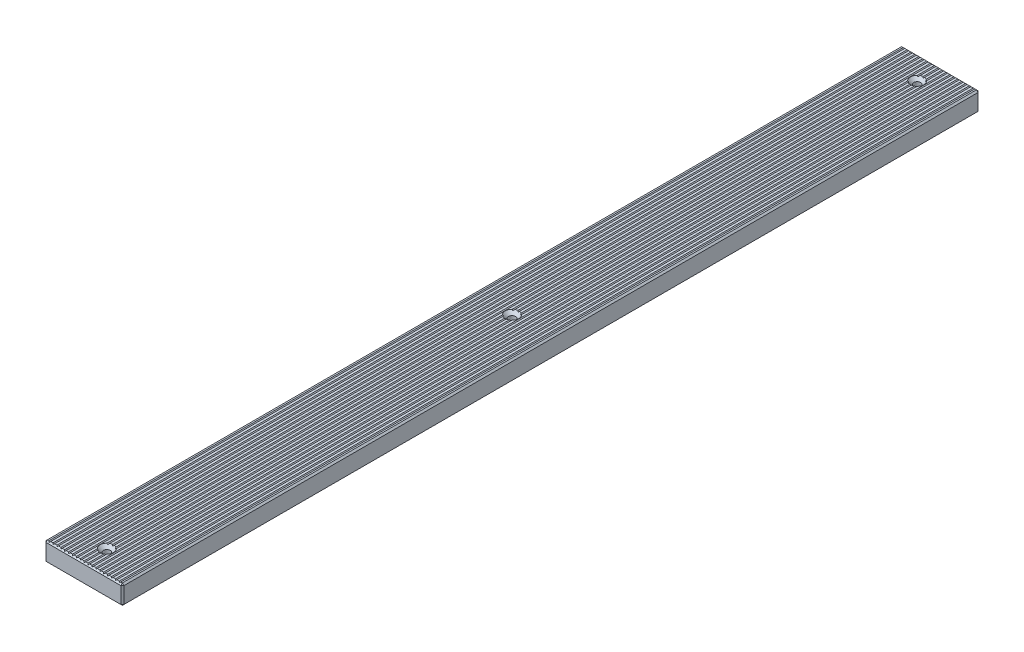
from build123d import *

# Parameters (mm, degrees)
ESQUISSE1_W                                    = 100
ESQUISSE1_H                                    = 25
BOSS_EXTRU_1_DEPTH                             = 550
CHANFREIN1_SIZE                                = 2
ENL_V_MAT_EXTRU_1_DEPTH                        = 1102.206724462
R_P_TITION_LIN_AIRE1_COUNT                     = 19
R_P_TITION_LIN_AIRE1_PITCH                     = 5
FRAISAGE_POUR_VIS_T_TE_FRAIS_E_M81_D           = 9
FRAISAGE_POUR_VIS_T_TE_FRAIS_E_M81_CSINK_D     = 17.3
FRAISAGE_POUR_VIS_T_TE_FRAIS_E_M81_CSINK_ANGLE = 90


with BuildPart() as part:
    # Esquisse1 → Boss.-Extru.1 (new, symmetric)
    with BuildSketch(Plane.XY):
        Rectangle(ESQUISSE1_W, ESQUISSE1_H)
    extrude(amount=BOSS_EXTRU_1_DEPTH, both=True)

    # Chanfrein1
    chanfrein1_edges = [part.edges().sort_by_distance(p)[0] for p in [
        (-50, 0, 550),
        (0, -12.5, 550),
        (50, 0, 550),
        (0, -12.5, -550),
        (-50, 0, -550),
        (0, 12.5, -550),
        (50, 0, -550),
        (0, 12.5, 550),
        (50, -12.5, 0),
        (-50, -12.5, 0),
        (-50, 12.5, 0),
        (50, 12.5, 0),
    ]]
    chamfer(chanfrein1_edges, length=CHANFREIN1_SIZE)

    # Esquisse2 → Enl_v. mat.-Extru.1 (cut, through all)
    with BuildSketch(Plane.XY.offset(550)):
        Polygon((-46, 12.5), (-44, 12.5), (-45, 11.5), align=None)
    enl_v_mat_extru_1 = extrude(amount=-ENL_V_MAT_EXTRU_1_DEPTH, mode=Mode.SUBTRACT)

    # R_p_tition lin_aire1: Enl_v. mat.-Extru.1 ×19
    with Locations(*[(i * R_P_TITION_LIN_AIRE1_PITCH, 0, 0) for i in range(1, R_P_TITION_LIN_AIRE1_COUNT)]):
        add(enl_v_mat_extru_1, mode=Mode.SUBTRACT)

    # Fraisage pour vis _ t_te frais_e M81 (through all)
    with Locations(Plane(origin=(0, 12.5, 0), x_dir=(-1, 0, 0), z_dir=(0, 1, 0))):
        with Locations((0, -520), (0, 0), (0, 520)):
            CounterSinkHole(FRAISAGE_POUR_VIS_T_TE_FRAIS_E_M81_D / 2, FRAISAGE_POUR_VIS_T_TE_FRAIS_E_M81_CSINK_D / 2, counter_sink_angle=FRAISAGE_POUR_VIS_T_TE_FRAIS_E_M81_CSINK_ANGLE)


solid = part.part
